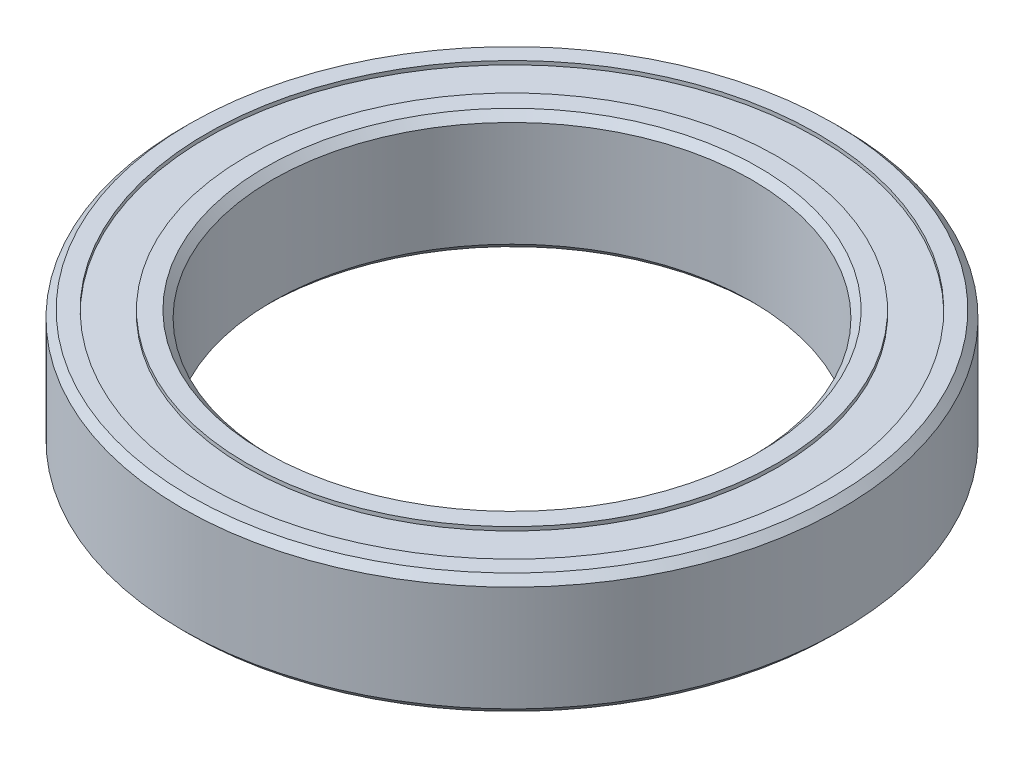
ISO-10303-21;
HEADER;
FILE_DESCRIPTION(('STEP AP214'),'2;1');
FILE_NAME('part.step','',(''),(''),'','','');
FILE_SCHEMA(('AUTOMOTIVE_DESIGN { 1 0 10303 214 1 1 1 1 }'));
ENDSEC;
DATA;
#1=APPLICATION_CONTEXT('core data for automotive mechanical design processes');
#2=APPLICATION_PROTOCOL_DEFINITION('international standard','automotive_design',2000,#1);
#3=PRODUCT_CONTEXT('',#1,'mechanical');
#4=PRODUCT('Part','Part','',(#3));
#5=PRODUCT_RELATED_PRODUCT_CATEGORY('part','',(#4));
#6=PRODUCT_DEFINITION_FORMATION('','',#4);
#7=PRODUCT_DEFINITION_CONTEXT('part definition',#1,'design');
#8=PRODUCT_DEFINITION('design','',#6,#7);
#9=PRODUCT_DEFINITION_SHAPE('','',#8);
#10=(LENGTH_UNIT() NAMED_UNIT(*) SI_UNIT(.MILLI.,.METRE.));
#11=(NAMED_UNIT(*) PLANE_ANGLE_UNIT() SI_UNIT($,.RADIAN.));
#12=(NAMED_UNIT(*) SI_UNIT($,.STERADIAN.) SOLID_ANGLE_UNIT());
#13=UNCERTAINTY_MEASURE_WITH_UNIT(LENGTH_MEASURE(1.E-05),#10,'distance_accuracy_value','');
#14=(GEOMETRIC_REPRESENTATION_CONTEXT(3) GLOBAL_UNCERTAINTY_ASSIGNED_CONTEXT((#13)) GLOBAL_UNIT_ASSIGNED_CONTEXT((#10,
#11,#12)) REPRESENTATION_CONTEXT('',''));
#15=CARTESIAN_POINT('',(0.,0.,0.));
#16=DIRECTION('',(0.,0.,1.));
#17=DIRECTION('',(1.,0.,0.));
#18=AXIS2_PLACEMENT_3D('',#15,#16,#17);
#19=CARTESIAN_POINT('',(0.,-3.175,0.));
#20=DIRECTION('',(0.,1.,0.));
#21=DIRECTION('',(0.,0.,1.));
#22=AXIS2_PLACEMENT_3D('',#19,#20,#21);
#23=PLANE('',#22);
#24=CARTESIAN_POINT('',(0.,-3.175,0.));
#25=DIRECTION('',(0.,1.,0.));
#26=DIRECTION('',(0.,0.,1.));
#27=AXIS2_PLACEMENT_3D('',#24,#25,#26);
#28=CIRCLE('',#27,17.0815);
#29=CARTESIAN_POINT('',(0.,-3.175,17.0815));
#30=VERTEX_POINT('',#29);
#31=EDGE_CURVE('E57',#30,#30,#28,.F.);
#32=ORIENTED_EDGE('',*,*,#31,.T.);
#33=EDGE_LOOP('',(#32));
#34=FACE_BOUND('',#33,.T.);
#35=CARTESIAN_POINT('',(0.,-3.175,0.));
#36=DIRECTION('',(0.,1.,0.));
#37=DIRECTION('',(0.,0.,1.));
#38=AXIS2_PLACEMENT_3D('',#35,#36,#37);
#39=CIRCLE('',#38,16.1798);
#40=CARTESIAN_POINT('',(0.,-3.175,16.1798));
#41=VERTEX_POINT('',#40);
#42=EDGE_CURVE('E79',#41,#41,#39,.T.);
#43=ORIENTED_EDGE('',*,*,#42,.T.);
#44=EDGE_LOOP('',(#43));
#45=FACE_BOUND('',#44,.T.);
#46=ADVANCED_FACE('F34',(#34,#45),#23,.F.);
#47=CARTESIAN_POINT('',(0.,3.175,0.));
#48=DIRECTION('',(0.,1.,0.));
#49=DIRECTION('',(0.,0.,1.));
#50=AXIS2_PLACEMENT_3D('',#47,#48,#49);
#51=PLANE('',#50);
#52=CARTESIAN_POINT('',(0.,3.175,0.));
#53=DIRECTION('',(0.,1.,0.));
#54=DIRECTION('',(0.,0.,1.));
#55=AXIS2_PLACEMENT_3D('',#52,#53,#54);
#56=CIRCLE('',#55,13.081);
#57=CARTESIAN_POINT('',(0.,3.175,13.081));
#58=VERTEX_POINT('',#57);
#59=EDGE_CURVE('E41',#58,#58,#56,.F.);
#60=ORIENTED_EDGE('',*,*,#59,.T.);
#61=EDGE_LOOP('',(#60));
#62=FACE_BOUND('',#61,.T.);
#63=CARTESIAN_POINT('',(0.,3.175,0.));
#64=DIRECTION('',(0.,1.,0.));
#65=DIRECTION('',(0.,0.,1.));
#66=AXIS2_PLACEMENT_3D('',#63,#64,#65);
#67=CIRCLE('',#66,14.0716);
#68=CARTESIAN_POINT('',(0.,3.175,14.0716));
#69=VERTEX_POINT('',#68);
#70=EDGE_CURVE('E73',#69,#69,#67,.T.);
#71=ORIENTED_EDGE('',*,*,#70,.T.);
#72=EDGE_LOOP('',(#71));
#73=FACE_BOUND('',#72,.T.);
#74=ADVANCED_FACE('F114',(#62,#73),#51,.T.);
#75=CARTESIAN_POINT('',(0.,3.175,0.));
#76=DIRECTION('',(0.,1.,0.));
#77=DIRECTION('',(0.,0.,1.));
#78=AXIS2_PLACEMENT_3D('',#75,#76,#77);
#79=CIRCLE('',#78,17.0815);
#80=CARTESIAN_POINT('',(0.,3.175,17.0815));
#81=VERTEX_POINT('',#80);
#82=EDGE_CURVE('E10',#81,#81,#79,.T.);
#83=ORIENTED_EDGE('',*,*,#82,.T.);
#84=EDGE_LOOP('',(#83));
#85=FACE_BOUND('',#84,.T.);
#86=CARTESIAN_POINT('',(0.,3.175,0.));
#87=DIRECTION('',(0.,1.,0.));
#88=DIRECTION('',(0.,0.,1.));
#89=AXIS2_PLACEMENT_3D('',#86,#87,#88);
#90=CIRCLE('',#89,16.1798);
#91=CARTESIAN_POINT('',(0.,3.175,16.1798));
#92=VERTEX_POINT('',#91);
#93=EDGE_CURVE('E67',#92,#92,#90,.T.);
#94=ORIENTED_EDGE('',*,*,#93,.F.);
#95=EDGE_LOOP('',(#94));
#96=FACE_BOUND('',#95,.T.);
#97=ADVANCED_FACE('F104',(#85,#96),#51,.T.);
#98=CARTESIAN_POINT('',(0.,-3.175,0.));
#99=DIRECTION('',(0.,1.,0.));
#100=DIRECTION('',(0.,0.,1.));
#101=AXIS2_PLACEMENT_3D('',#98,#99,#100);
#102=CIRCLE('',#101,13.081);
#103=CARTESIAN_POINT('',(0.,-3.175,13.081));
#104=VERTEX_POINT('',#103);
#105=EDGE_CURVE('E54',#104,#104,#102,.T.);
#106=ORIENTED_EDGE('',*,*,#105,.T.);
#107=EDGE_LOOP('',(#106));
#108=FACE_BOUND('',#107,.T.);
#109=CARTESIAN_POINT('',(0.,-3.175,0.));
#110=DIRECTION('',(0.,1.,0.));
#111=DIRECTION('',(0.,0.,1.));
#112=AXIS2_PLACEMENT_3D('',#109,#110,#111);
#113=CIRCLE('',#112,14.0716);
#114=CARTESIAN_POINT('',(0.,-3.175,14.0716));
#115=VERTEX_POINT('',#114);
#116=EDGE_CURVE('E85',#115,#115,#113,.T.);
#117=ORIENTED_EDGE('',*,*,#116,.F.);
#118=EDGE_LOOP('',(#117));
#119=FACE_BOUND('',#118,.T.);
#120=ADVANCED_FACE('F101',(#108,#119),#23,.F.);
#121=CARTESIAN_POINT('',(0.,3.175,0.));
#122=DIRECTION('',(0.,-1.,0.));
#123=DIRECTION('',(0.,0.,-1.));
#124=AXIS2_PLACEMENT_3D('',#121,#122,#123);
#125=CYLINDRICAL_SURFACE('',#124,17.4625);
#126=CARTESIAN_POINT('',(0.,-2.794,0.));
#127=DIRECTION('',(0.,1.,0.));
#128=DIRECTION('',(0.,0.,1.));
#129=AXIS2_PLACEMENT_3D('',#126,#127,#128);
#130=CIRCLE('',#129,17.4625);
#131=CARTESIAN_POINT('',(0.,-2.794,17.4625));
#132=VERTEX_POINT('',#131);
#133=EDGE_CURVE('E60',#132,#132,#130,.T.);
#134=ORIENTED_EDGE('',*,*,#133,.T.);
#135=EDGE_LOOP('',(#134));
#136=FACE_BOUND('',#135,.T.);
#137=CARTESIAN_POINT('',(0.,2.79400000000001,0.));
#138=DIRECTION('',(0.,1.,0.));
#139=DIRECTION('',(0.,0.,1.));
#140=AXIS2_PLACEMENT_3D('',#137,#138,#139);
#141=CIRCLE('',#140,17.4625);
#142=CARTESIAN_POINT('',(0.,2.79400000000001,17.4625));
#143=VERTEX_POINT('',#142);
#144=EDGE_CURVE('E63',#143,#143,#141,.F.);
#145=ORIENTED_EDGE('',*,*,#144,.T.);
#146=EDGE_LOOP('',(#145));
#147=FACE_BOUND('',#146,.T.);
#148=ADVANCED_FACE('F103',(#136,#147),#125,.T.);
#149=CARTESIAN_POINT('',(0.,3.175,0.));
#150=DIRECTION('',(0.,-1.,0.));
#151=DIRECTION('',(0.,0.,-1.));
#152=AXIS2_PLACEMENT_3D('',#149,#150,#151);
#153=CYLINDRICAL_SURFACE('',#152,12.7);
#154=CARTESIAN_POINT('',(0.,-2.794,0.));
#155=DIRECTION('',(0.,1.,0.));
#156=DIRECTION('',(0.,0.,1.));
#157=AXIS2_PLACEMENT_3D('',#154,#155,#156);
#158=CIRCLE('',#157,12.7);
#159=CARTESIAN_POINT('',(0.,-2.794,12.7));
#160=VERTEX_POINT('',#159);
#161=EDGE_CURVE('E45',#160,#160,#158,.F.);
#162=ORIENTED_EDGE('',*,*,#161,.T.);
#163=EDGE_LOOP('',(#162));
#164=FACE_BOUND('',#163,.T.);
#165=CARTESIAN_POINT('',(0.,2.794,0.));
#166=DIRECTION('',(0.,1.,0.));
#167=DIRECTION('',(0.,0.,1.));
#168=AXIS2_PLACEMENT_3D('',#165,#166,#167);
#169=CIRCLE('',#168,12.7);
#170=CARTESIAN_POINT('',(0.,2.794,12.7));
#171=VERTEX_POINT('',#170);
#172=EDGE_CURVE('E49',#171,#171,#169,.T.);
#173=ORIENTED_EDGE('',*,*,#172,.T.);
#174=EDGE_LOOP('',(#173));
#175=FACE_BOUND('',#174,.T.);
#176=ADVANCED_FACE('F111',(#164,#175),#153,.F.);
#177=CARTESIAN_POINT('',(0.,2.975,0.));
#178=DIRECTION('',(0.,1.,0.));
#179=DIRECTION('',(0.,0.,1.));
#180=AXIS2_PLACEMENT_3D('',#177,#178,#179);
#181=CYLINDRICAL_SURFACE('',#180,16.1798);
#182=CARTESIAN_POINT('',(0.,2.975,0.));
#183=DIRECTION('',(0.,1.,0.));
#184=DIRECTION('',(0.,0.,1.));
#185=AXIS2_PLACEMENT_3D('',#182,#183,#184);
#186=CIRCLE('',#185,16.1798);
#187=CARTESIAN_POINT('',(0.,2.975,16.1798));
#188=VERTEX_POINT('',#187);
#189=EDGE_CURVE('E66',#188,#188,#186,.T.);
#190=ORIENTED_EDGE('',*,*,#189,.F.);
#191=EDGE_LOOP('',(#190));
#192=FACE_BOUND('',#191,.T.);
#193=ORIENTED_EDGE('',*,*,#93,.T.);
#194=EDGE_LOOP('',(#193));
#195=FACE_BOUND('',#194,.T.);
#196=ADVANCED_FACE('F141',(#192,#195),#181,.F.);
#197=CARTESIAN_POINT('',(0.,2.975,0.));
#198=DIRECTION('',(0.,1.,0.));
#199=DIRECTION('',(0.,0.,1.));
#200=AXIS2_PLACEMENT_3D('',#197,#198,#199);
#201=PLANE('',#200);
#202=CARTESIAN_POINT('',(0.,2.975,0.));
#203=DIRECTION('',(0.,1.,0.));
#204=DIRECTION('',(0.,0.,1.));
#205=AXIS2_PLACEMENT_3D('',#202,#203,#204);
#206=CIRCLE('',#205,14.0716);
#207=CARTESIAN_POINT('',(0.,2.975,14.0716));
#208=VERTEX_POINT('',#207);
#209=EDGE_CURVE('E70',#208,#208,#206,.T.);
#210=ORIENTED_EDGE('',*,*,#209,.F.);
#211=EDGE_LOOP('',(#210));
#212=FACE_BOUND('',#211,.T.);
#213=ORIENTED_EDGE('',*,*,#189,.T.);
#214=EDGE_LOOP('',(#213));
#215=FACE_BOUND('',#214,.T.);
#216=ADVANCED_FACE('F137',(#212,#215),#201,.T.);
#217=CARTESIAN_POINT('',(0.,2.975,0.));
#218=DIRECTION('',(0.,1.,0.));
#219=DIRECTION('',(0.,0.,1.));
#220=AXIS2_PLACEMENT_3D('',#217,#218,#219);
#221=CYLINDRICAL_SURFACE('',#220,14.0716);
#222=ORIENTED_EDGE('',*,*,#209,.T.);
#223=EDGE_LOOP('',(#222));
#224=FACE_BOUND('',#223,.T.);
#225=ORIENTED_EDGE('',*,*,#70,.F.);
#226=EDGE_LOOP('',(#225));
#227=FACE_BOUND('',#226,.T.);
#228=ADVANCED_FACE('F131',(#224,#227),#221,.T.);
#229=CARTESIAN_POINT('',(0.,-2.975,0.));
#230=DIRECTION('',(0.,-1.,0.));
#231=DIRECTION('',(0.,0.,1.));
#232=AXIS2_PLACEMENT_3D('',#229,#230,#231);
#233=PLANE('',#232);
#234=CARTESIAN_POINT('',(0.,-2.975,0.));
#235=DIRECTION('',(0.,1.,0.));
#236=DIRECTION('',(0.,0.,1.));
#237=AXIS2_PLACEMENT_3D('',#234,#235,#236);
#238=CIRCLE('',#237,16.1798);
#239=CARTESIAN_POINT('',(0.,-2.975,16.1798));
#240=VERTEX_POINT('',#239);
#241=EDGE_CURVE('E76',#240,#240,#238,.T.);
#242=ORIENTED_EDGE('',*,*,#241,.F.);
#243=EDGE_LOOP('',(#242));
#244=FACE_BOUND('',#243,.T.);
#245=CARTESIAN_POINT('',(0.,-2.975,0.));
#246=DIRECTION('',(0.,1.,0.));
#247=DIRECTION('',(0.,0.,1.));
#248=AXIS2_PLACEMENT_3D('',#245,#246,#247);
#249=CIRCLE('',#248,14.0716);
#250=CARTESIAN_POINT('',(0.,-2.975,14.0716));
#251=VERTEX_POINT('',#250);
#252=EDGE_CURVE('E82',#251,#251,#249,.T.);
#253=ORIENTED_EDGE('',*,*,#252,.T.);
#254=EDGE_LOOP('',(#253));
#255=FACE_BOUND('',#254,.T.);
#256=ADVANCED_FACE('F91',(#244,#255),#233,.T.);
#257=CARTESIAN_POINT('',(0.,-2.975,0.));
#258=DIRECTION('',(0.,-1.,0.));
#259=DIRECTION('',(0.,0.,-1.));
#260=AXIS2_PLACEMENT_3D('',#257,#258,#259);
#261=CYLINDRICAL_SURFACE('',#260,16.1798);
#262=ORIENTED_EDGE('',*,*,#241,.T.);
#263=EDGE_LOOP('',(#262));
#264=FACE_BOUND('',#263,.T.);
#265=ORIENTED_EDGE('',*,*,#42,.F.);
#266=EDGE_LOOP('',(#265));
#267=FACE_BOUND('',#266,.T.);
#268=ADVANCED_FACE('F97',(#264,#267),#261,.F.);
#269=CARTESIAN_POINT('',(0.,-2.975,0.));
#270=DIRECTION('',(0.,-1.,0.));
#271=DIRECTION('',(0.,0.,-1.));
#272=AXIS2_PLACEMENT_3D('',#269,#270,#271);
#273=CYLINDRICAL_SURFACE('',#272,14.0716);
#274=ORIENTED_EDGE('',*,*,#252,.F.);
#275=EDGE_LOOP('',(#274));
#276=FACE_BOUND('',#275,.T.);
#277=ORIENTED_EDGE('',*,*,#116,.T.);
#278=EDGE_LOOP('',(#277));
#279=FACE_BOUND('',#278,.T.);
#280=ADVANCED_FACE('F93',(#276,#279),#273,.T.);
#281=CARTESIAN_POINT('',(0.,-2.794,0.));
#282=DIRECTION('',(0.,1.,0.));
#283=DIRECTION('',(0.,0.,1.));
#284=AXIS2_PLACEMENT_3D('',#281,#282,#283);
#285=CONICAL_SURFACE('',#284,17.4625,0.785398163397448);
#286=ORIENTED_EDGE('',*,*,#31,.F.);
#287=EDGE_LOOP('',(#286));
#288=FACE_BOUND('',#287,.T.);
#289=ORIENTED_EDGE('',*,*,#133,.F.);
#290=EDGE_LOOP('',(#289));
#291=FACE_BOUND('',#290,.T.);
#292=ADVANCED_FACE('F96',(#288,#291),#285,.T.);
#293=CARTESIAN_POINT('',(0.,-3.175,0.));
#294=DIRECTION('',(0.,-1.,0.));
#295=DIRECTION('',(0.,0.,-1.));
#296=AXIS2_PLACEMENT_3D('',#293,#294,#295);
#297=CONICAL_SURFACE('',#296,13.081,0.785398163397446);
#298=ORIENTED_EDGE('',*,*,#161,.F.);
#299=EDGE_LOOP('',(#298));
#300=FACE_BOUND('',#299,.T.);
#301=ORIENTED_EDGE('',*,*,#105,.F.);
#302=EDGE_LOOP('',(#301));
#303=FACE_BOUND('',#302,.T.);
#304=ADVANCED_FACE('F156',(#300,#303),#297,.F.);
#305=CARTESIAN_POINT('',(0.,2.794,0.));
#306=DIRECTION('',(0.,1.,0.));
#307=DIRECTION('',(0.,0.,1.));
#308=AXIS2_PLACEMENT_3D('',#305,#306,#307);
#309=CONICAL_SURFACE('',#308,12.7,0.785398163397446);
#310=ORIENTED_EDGE('',*,*,#59,.F.);
#311=EDGE_LOOP('',(#310));
#312=FACE_BOUND('',#311,.T.);
#313=ORIENTED_EDGE('',*,*,#172,.F.);
#314=EDGE_LOOP('',(#313));
#315=FACE_BOUND('',#314,.T.);
#316=ADVANCED_FACE('F154',(#312,#315),#309,.F.);
#317=CARTESIAN_POINT('',(0.,3.175,0.));
#318=DIRECTION('',(0.,-1.,0.));
#319=DIRECTION('',(0.,0.,-1.));
#320=AXIS2_PLACEMENT_3D('',#317,#318,#319);
#321=CONICAL_SURFACE('',#320,17.0815,0.785398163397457);
#322=ORIENTED_EDGE('',*,*,#144,.F.);
#323=EDGE_LOOP('',(#322));
#324=FACE_BOUND('',#323,.T.);
#325=ORIENTED_EDGE('',*,*,#82,.F.);
#326=EDGE_LOOP('',(#325));
#327=FACE_BOUND('',#326,.T.);
#328=ADVANCED_FACE('F36',(#324,#327),#321,.T.);
#329=CLOSED_SHELL('',(#46,#74,#97,#120,#148,#176,#196,#216,#228,#256,#268,#280,#292,#304,#316,#328));
#330=MANIFOLD_SOLID_BREP('B2',#329);
#331=ADVANCED_BREP_SHAPE_REPRESENTATION('',(#18,#330),#14);
#332=SHAPE_DEFINITION_REPRESENTATION(#9,#331);
ENDSEC;
END-ISO-10303-21;
